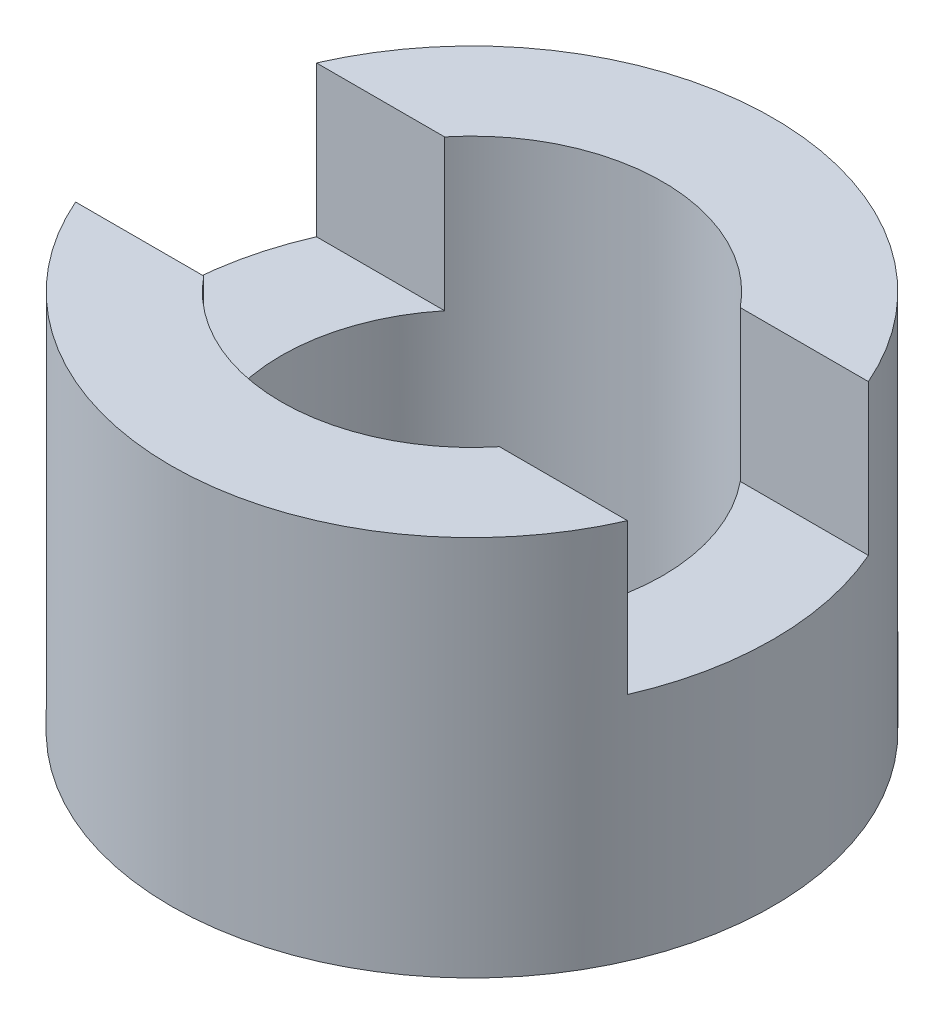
from build123d import *

# Parameters (mm, degrees)
ESQUISSE1_W             = 11
ESQUISSE1_H             = 38
ESQUISSE2_W             = 24
ESQUISSE2_H             = 15.527661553
ENL_V_MAT_EXTRU_1_DEPTH = 40


with BuildPart() as part:
    # Esquisse1 → Base-R_volution (revolve)
    with BuildSketch(Plane.XY, mode=Mode.PRIVATE) as base_r_volution_sk:
        with Locations((24.5, 19)):
            Rectangle(ESQUISSE1_W, ESQUISSE1_H)
    revolve(base_r_volution_sk.sketch.rotate(Axis((0, 46.176987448, 0), (0, -1, 0)), 90), axis=Axis((0, 46.176987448, 0), (0, -1, 0)))

    # Esquisse2 → Enl_v. mat.-Extru.1 (cut, symmetric)
    with BuildSketch(Plane(origin=(0, 0, 0), x_dir=(0, 0, -1), z_dir=(1, 0, 0))):
        with Locations((0, 30.763830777)):
            Rectangle(ESQUISSE2_W, ESQUISSE2_H)
    extrude(amount=ENL_V_MAT_EXTRU_1_DEPTH, both=True, mode=Mode.SUBTRACT)


solid = part.part
